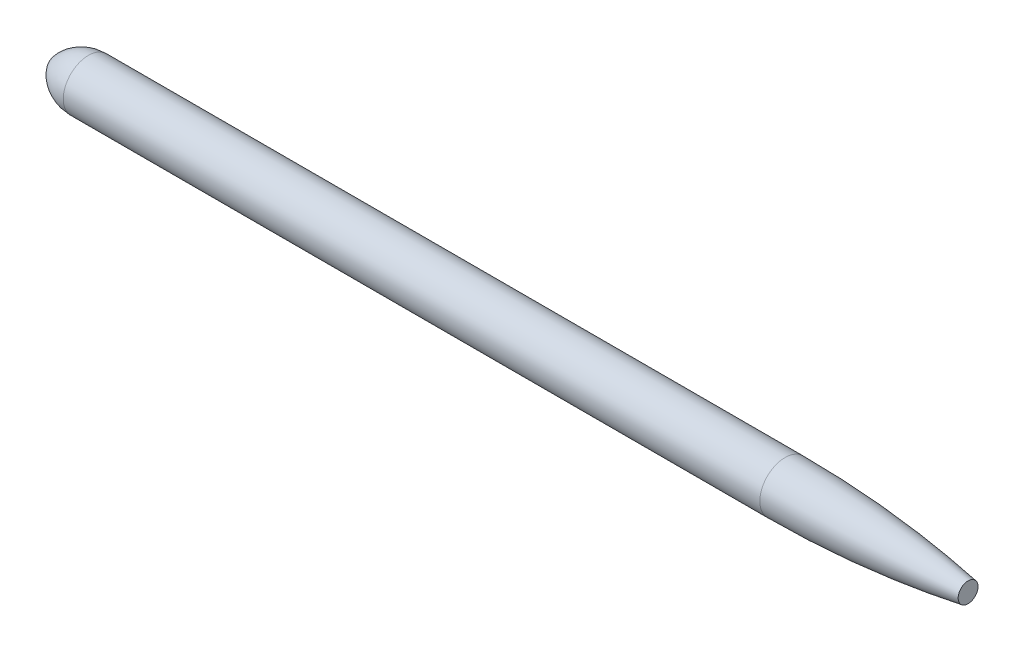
ISO-10303-21;
HEADER;
FILE_DESCRIPTION(('STEP AP214'),'2;1');
FILE_NAME('part.step','',(''),(''),'','','');
FILE_SCHEMA(('AUTOMOTIVE_DESIGN { 1 0 10303 214 1 1 1 1 }'));
ENDSEC;
DATA;
#1=APPLICATION_CONTEXT('core data for automotive mechanical design processes');
#2=APPLICATION_PROTOCOL_DEFINITION('international standard','automotive_design',2000,#1);
#3=PRODUCT_CONTEXT('',#1,'mechanical');
#4=PRODUCT('Part','Part','',(#3));
#5=PRODUCT_RELATED_PRODUCT_CATEGORY('part','',(#4));
#6=PRODUCT_DEFINITION_FORMATION('','',#4);
#7=PRODUCT_DEFINITION_CONTEXT('part definition',#1,'design');
#8=PRODUCT_DEFINITION('design','',#6,#7);
#9=PRODUCT_DEFINITION_SHAPE('','',#8);
#10=(LENGTH_UNIT() NAMED_UNIT(*) SI_UNIT(.MILLI.,.METRE.));
#11=(NAMED_UNIT(*) PLANE_ANGLE_UNIT() SI_UNIT($,.RADIAN.));
#12=(NAMED_UNIT(*) SI_UNIT($,.STERADIAN.) SOLID_ANGLE_UNIT());
#13=UNCERTAINTY_MEASURE_WITH_UNIT(LENGTH_MEASURE(1.E-05),#10,'distance_accuracy_value','');
#14=(GEOMETRIC_REPRESENTATION_CONTEXT(3) GLOBAL_UNCERTAINTY_ASSIGNED_CONTEXT((#13)) GLOBAL_UNIT_ASSIGNED_CONTEXT((#10,
#11,#12)) REPRESENTATION_CONTEXT('',''));
#15=CARTESIAN_POINT('',(0.,0.,0.));
#16=DIRECTION('',(0.,0.,1.));
#17=DIRECTION('',(1.,0.,0.));
#18=AXIS2_PLACEMENT_3D('',#15,#16,#17);
#19=CARTESIAN_POINT('',(270.,0.,-116.105624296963));
#20=DIRECTION('',(0.,-1.,0.));
#21=DIRECTION('',(0.,0.,1.));
#22=AXIS2_PLACEMENT_3D('',#19,#20,#21);
#23=CIRCLE('',#22,293.905624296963);
#24=TRIMMED_CURVE('',#23,(PARAMETER_VALUE(-1.16468068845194)),
(PARAMETER_VALUE(1.16468068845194)),.T.,.PARAMETER.);
#25=CARTESIAN_POINT('',(270.,0.,0.));
#26=DIRECTION('',(-1.,0.,0.));
#27=AXIS1_PLACEMENT('',#25,#26);
#28=SURFACE_OF_REVOLUTION('',#24,#27);
#29=CARTESIAN_POINT('',(270.,0.,0.));
#30=DIRECTION('',(-1.,0.,0.));
#31=DIRECTION('',(0.,0.,1.));
#32=AXIS2_PLACEMENT_3D('',#29,#30,#31);
#33=CIRCLE('',#32,177.8);
#34=CARTESIAN_POINT('',(270.,0.,177.8));
#35=VERTEX_POINT('',#34);
#36=EDGE_CURVE('E52',#35,#35,#33,.T.);
#37=ORIENTED_EDGE('',*,*,#36,.T.);
#38=EDGE_LOOP('',(#37));
#39=FACE_BOUND('',#38,.T.);
#40=CARTESIAN_POINT('',(0.,0.,0.));
#41=VERTEX_POINT('',#40);
#42=VERTEX_LOOP('',#41);
#43=FACE_BOUND('',#42,.T.);
#44=ADVANCED_FACE('F33',(#39,#43),#28,.T.);
#45=CARTESIAN_POINT('',(6470.,0.,70.));
#46=DIRECTION('',(1.,0.,0.));
#47=DIRECTION('',(0.,0.,-1.));
#48=AXIS2_PLACEMENT_3D('',#45,#46,#47);
#49=PLANE('',#48);
#50=CARTESIAN_POINT('',(6470.,0.,0.));
#51=DIRECTION('',(-1.,0.,0.));
#52=DIRECTION('',(0.,0.,1.));
#53=AXIS2_PLACEMENT_3D('',#50,#51,#52);
#54=CIRCLE('',#53,70.);
#55=CARTESIAN_POINT('',(6470.,0.,70.));
#56=VERTEX_POINT('',#55);
#57=EDGE_CURVE('E11',#56,#56,#54,.T.);
#58=ORIENTED_EDGE('',*,*,#57,.F.);
#59=EDGE_LOOP('',(#58));
#60=FACE_BOUND('',#59,.T.);
#61=ADVANCED_FACE('F43',(#60),#49,.T.);
#62=CARTESIAN_POINT('',(5180.,0.,0.));
#63=DIRECTION('',(-1.,0.,0.));
#64=DIRECTION('',(0.,0.,1.));
#65=AXIS2_PLACEMENT_3D('',#62,#63,#64);
#66=DEGENERATE_TOROIDAL_SURFACE('',#65,7594.56011131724,7772.36011131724,.F.);
#67=ORIENTED_EDGE('',*,*,#57,.T.);
#68=EDGE_LOOP('',(#67));
#69=FACE_BOUND('',#68,.T.);
#70=CARTESIAN_POINT('',(5180.,0.,0.));
#71=DIRECTION('',(-1.,0.,0.));
#72=DIRECTION('',(0.,0.,1.));
#73=AXIS2_PLACEMENT_3D('',#70,#71,#72);
#74=CIRCLE('',#73,177.8);
#75=CARTESIAN_POINT('',(5180.,0.,177.8));
#76=VERTEX_POINT('',#75);
#77=EDGE_CURVE('E39',#76,#76,#74,.T.);
#78=ORIENTED_EDGE('',*,*,#77,.F.);
#79=EDGE_LOOP('',(#78));
#80=FACE_BOUND('',#79,.T.);
#81=ADVANCED_FACE('F48',(#69,#80),#66,.F.);
#82=CARTESIAN_POINT('',(0.,0.,0.));
#83=DIRECTION('',(-1.,0.,0.));
#84=DIRECTION('',(0.,0.,1.));
#85=AXIS2_PLACEMENT_3D('',#82,#83,#84);
#86=CYLINDRICAL_SURFACE('',#85,177.8);
#87=ORIENTED_EDGE('',*,*,#77,.T.);
#88=EDGE_LOOP('',(#87));
#89=FACE_BOUND('',#88,.T.);
#90=ORIENTED_EDGE('',*,*,#36,.F.);
#91=EDGE_LOOP('',(#90));
#92=FACE_BOUND('',#91,.T.);
#93=ADVANCED_FACE('F58',(#89,#92),#86,.T.);
#94=CLOSED_SHELL('',(#44,#61,#81,#93));
#95=MANIFOLD_SOLID_BREP('B2',#94);
#96=ADVANCED_BREP_SHAPE_REPRESENTATION('',(#18,#95),#14);
#97=SHAPE_DEFINITION_REPRESENTATION(#9,#96);
ENDSEC;
END-ISO-10303-21;
